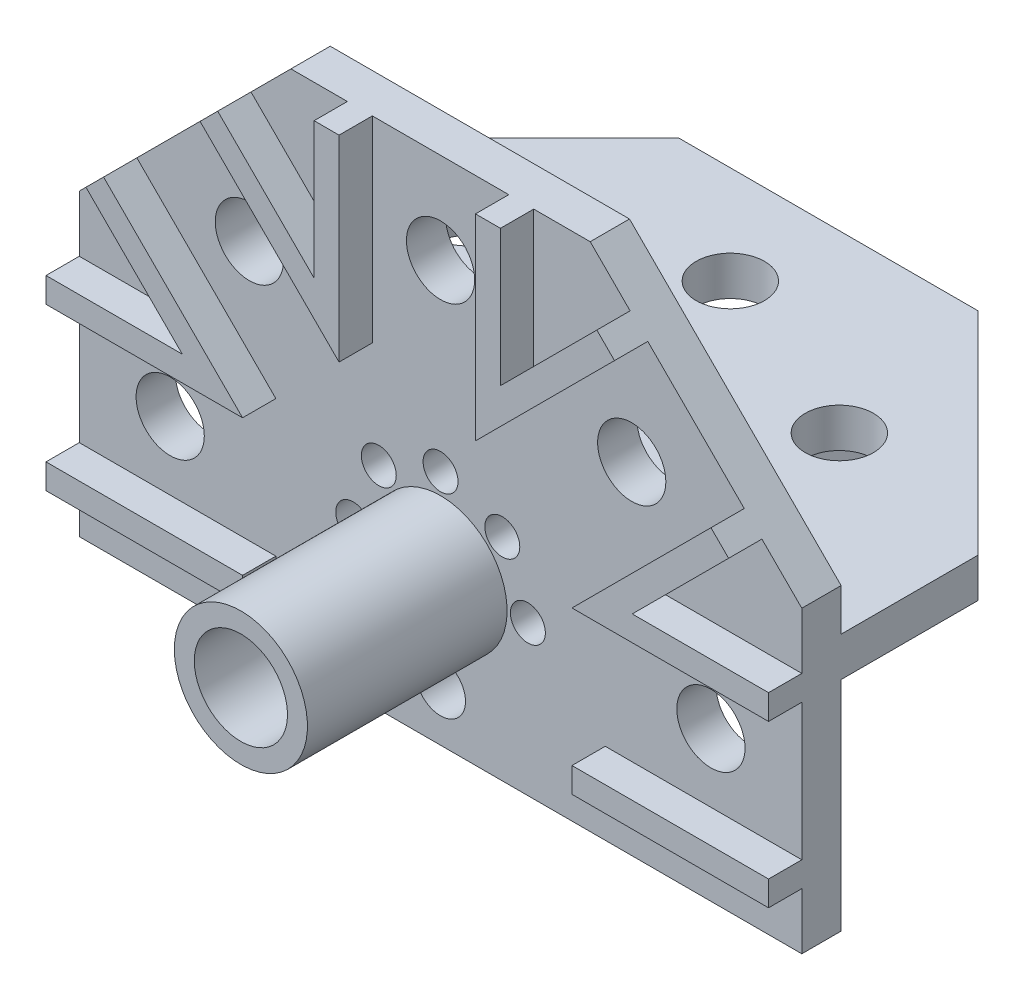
from build123d import *

# Parameters (mm, degrees)
BOSS_EXTRUDE1_DEPTH = 3
SKETCH2_R           = 5.08
SKETCH2_R_2         = 3.556
BOSS_EXTRUDE2_DEPTH = 15.24
SKETCH3_R           = 1.3335
CUT_EXTRUDE1_DEPTH  = 2.2
SKETCH4_R           = 2.6035
SKETCH4_R_2         = 1.905
CUT_EXTRUDE2_DEPTH  = 16.637
BOSS_EXTRUDE3_DEPTH = 2.54
SKETCH6_W           = 55.15
SKETCH6_H           = 3
BOSS_EXTRUDE4_DEPTH = 26.6
CUT_EXTRUDE3_DEPTH  = 45.365167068
SKETCH8_R           = 2.6035
CUT_EXTRUDE4_DEPTH  = 45.365167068
BOSS_EXTRUDE5_DEPTH = 2.54
SKETCH10_R          = 1.275
CUT_EXTRUDE5_DEPTH  = 2.5


with BuildPart() as part:
    # Sketch1 → Boss-Extrude1 (new body)
    with BuildSketch(Plane.XY):
        Polygon((-27.575, 0), (27.575, 0), (27.575, 22.843877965), (11.421938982, 38.996938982), (-11.421938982, 38.996938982), (-27.575, 22.843877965), align=None)
    extrude(amount=BOSS_EXTRUDE1_DEPTH)

    # Sketch2 → Boss-Extrude2 (add)
    with BuildSketch(Plane.XY.offset(3)):
        with Locations(Location((0, 11.421938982, 0), (0, 0, 180))):
            Circle(SKETCH2_R)
        with Locations(Location((0, 11.421938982, 0), (0, 0, 180))):
            Circle(SKETCH2_R_2, mode=Mode.SUBTRACT)
    extrude(amount=BOSS_EXTRUDE2_DEPTH)

    # Sketch3 → Cut-Extrude1 (cut)
    with BuildSketch(Plane.XY.offset(3)):
        with Locations((6.666427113, 11.421938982)):
            Circle(SKETCH3_R)
        with Locations((-6.666427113, 11.421938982)):
            Circle(SKETCH3_R)
        with Locations((-4.713875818, 16.1358148)):
            Circle(SKETCH3_R)
        with Locations((0, 18.088366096)):
            Circle(SKETCH3_R)
        with Locations((4.713875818, 16.1358148)):
            Circle(SKETCH3_R)
    extrude(amount=-CUT_EXTRUDE1_DEPTH, mode=Mode.SUBTRACT)

    # Sketch4 → Cut-Extrude2 (cut)
    with BuildSketch(Plane.XY.offset(3)):
        with Locations((20.636427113, 11.421938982)):
            Circle(SKETCH4_R)
        with Locations((0, 3.8493868)):
            Circle(SKETCH4_R_2)
        with Locations((-20.636427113, 11.421938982)):
            Circle(SKETCH4_R)
        with Locations((-14.592157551, 26.014096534)):
            Circle(SKETCH4_R)
        with Locations((0, 32.058366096)):
            Circle(SKETCH4_R)
        with Locations((14.592157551, 26.014096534)):
            Circle(SKETCH4_R)
    extrude(amount=-CUT_EXTRUDE2_DEPTH, mode=Mode.SUBTRACT)

    # Sketch5 → Boss-Extrude3 (add)
    with BuildSketch(Plane.XY.offset(3)):
        Polygon((5.207, 38.996938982), (5.207, 23.992749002), (15.816564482, 34.602313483), (14.469526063, 35.949351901), (7.112, 28.591825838), (7.112, 38.996938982), align=None)
        Polygon((12.570810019, 16.628938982), (27.575, 16.628938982), (27.575, 18.533938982), (17.169886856, 18.533938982), (24.527412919, 25.891465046), (23.180374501, 27.238503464), align=None)
        Polygon((-12.570810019, 6.214938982), (-12.570810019, 4.309938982), (-17.169886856, 4.309938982), (-27.575, 4.309938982), (-27.575, 6.214938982), align=None)
        Polygon((27.575, 6.214938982), (12.570810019, 6.214938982), (12.570810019, 4.309938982), (17.169886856, 4.309938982), (27.575, 4.309938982), align=None)
        Polygon((-12.570810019, 16.628938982), (-23.180374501, 27.238503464), (-24.527412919, 25.891465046), (-17.169886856, 18.533938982), (-27.575, 18.533938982), (-27.575, 16.628938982), align=None)
        Polygon((-5.207, 23.992749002), (-5.207, 38.996938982), (-7.112, 38.996938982), (-7.112, 28.591825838), (-14.469526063, 35.949351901), (-15.816564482, 34.602313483), align=None)
    extrude(amount=BOSS_EXTRUDE3_DEPTH)

    # Sketch6 → Boss-Extrude4 (add)
    with BuildSketch(Plane(origin=(0, 0, 0), x_dir=(-1, 0, 0), z_dir=(0, 0, -1))):
        with Locations((0, 18.128938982)):
            Rectangle(SKETCH6_W, SKETCH6_H)
    extrude(amount=BOSS_EXTRUDE4_DEPTH)

    # Sketch7 → Cut-Extrude3 (cut, through all)
    with BuildSketch(Plane.XZ.offset(-16.628938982)):
        Polygon((-11.421938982, -26.6), (-27.575, -10.446938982), (-27.575, -26.6), align=None)
        Polygon((27.575, -10.446938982), (11.421938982, -26.6), (27.575, -26.6), align=None)
    extrude(amount=-CUT_EXTRUDE3_DEPTH, mode=Mode.SUBTRACT)

    # Sketch8 → Cut-Extrude4 (cut, through all)
    with BuildSketch(Plane.XZ.offset(-16.628938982)):
        with Locations(Location((-14.206721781, -13.231721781, 0), (0, 0, 270))):
            Circle(SKETCH8_R)
        with Locations(Location((0, -19.11633862, 0), (0, 0, 270))):
            Circle(SKETCH8_R)
        with Locations(Location((14.206721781, -13.231721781, 0), (0, 0, 270))):
            Circle(SKETCH8_R)
    extrude(amount=-CUT_EXTRUDE4_DEPTH, mode=Mode.SUBTRACT)

    # Sketch9 → Boss-Extrude5 (add)
    with BuildSketch(Plane.XZ.offset(-16.628938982)):
        Polygon((5.207, -26.6), (5.207, -11.595810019), (15.816564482, -22.205374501), (14.579127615, -23.442811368), (6.957, -15.820683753), (6.957, -26.6), align=None)
        Polygon((-14.579127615, -23.442811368), (-6.957, -15.820683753), (-6.957, -26.6), (-5.207, -26.6), (-5.207, -11.595810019), (-15.816564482, -22.205374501), align=None)
        Polygon((-12.570810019, -4.232), (-13.808246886, -2.994563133), (-16.795683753, -5.982), (-24.417811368, -13.604127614), (-23.180374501, -14.841564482), align=None)
        Polygon((12.570810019, -4.232), (13.808246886, -2.994563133), (16.795683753, -5.982), (24.417811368, -13.604127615), (23.180374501, -14.841564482), align=None)
    extrude(amount=BOSS_EXTRUDE5_DEPTH)

    # Sketch10 → Cut-Extrude5 (cut)
    with BuildSketch(Plane.XZ.offset(-16.628938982)):
        with Locations(Location((0, -5.14633862, 0), (0, 0, 270))):
            Circle(SKETCH10_R)
        with Locations(Location((-4.323329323, -3.355556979, 0), (0, 0, 270))):
            Circle(SKETCH10_R)
        with Locations(Location((4.323329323, -3.355556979, 0), (0, 0, 270))):
            Circle(SKETCH10_R)
    extrude(amount=-CUT_EXTRUDE5_DEPTH, mode=Mode.SUBTRACT)


solid = part.part
